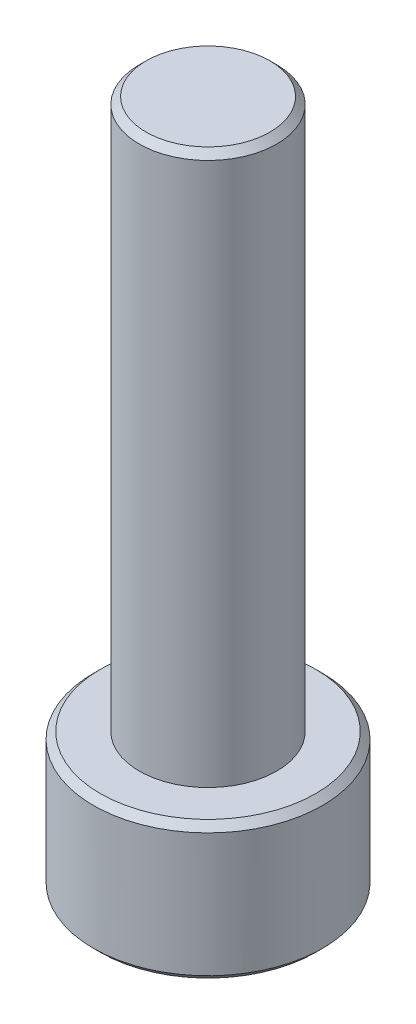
ISO-10303-21;
HEADER;
FILE_DESCRIPTION(('STEP AP214'),'2;1');
FILE_NAME('part.step','',(''),(''),'','','');
FILE_SCHEMA(('AUTOMOTIVE_DESIGN { 1 0 10303 214 1 1 1 1 }'));
ENDSEC;
DATA;
#1=APPLICATION_CONTEXT('core data for automotive mechanical design processes');
#2=APPLICATION_PROTOCOL_DEFINITION('international standard','automotive_design',2000,#1);
#3=PRODUCT_CONTEXT('',#1,'mechanical');
#4=PRODUCT('Part','Part','',(#3));
#5=PRODUCT_RELATED_PRODUCT_CATEGORY('part','',(#4));
#6=PRODUCT_DEFINITION_FORMATION('','',#4);
#7=PRODUCT_DEFINITION_CONTEXT('part definition',#1,'design');
#8=PRODUCT_DEFINITION('design','',#6,#7);
#9=PRODUCT_DEFINITION_SHAPE('','',#8);
#10=(LENGTH_UNIT() NAMED_UNIT(*) SI_UNIT(.MILLI.,.METRE.));
#11=(NAMED_UNIT(*) PLANE_ANGLE_UNIT() SI_UNIT($,.RADIAN.));
#12=(NAMED_UNIT(*) SI_UNIT($,.STERADIAN.) SOLID_ANGLE_UNIT());
#13=UNCERTAINTY_MEASURE_WITH_UNIT(LENGTH_MEASURE(1.E-05),#10,'distance_accuracy_value','');
#14=(GEOMETRIC_REPRESENTATION_CONTEXT(3) GLOBAL_UNCERTAINTY_ASSIGNED_CONTEXT((#13)) GLOBAL_UNIT_ASSIGNED_CONTEXT((#10,
#11,#12)) REPRESENTATION_CONTEXT('',''));
#15=CARTESIAN_POINT('',(0.,0.,0.));
#16=DIRECTION('',(0.,0.,1.));
#17=DIRECTION('',(1.,0.,0.));
#18=AXIS2_PLACEMENT_3D('',#15,#16,#17);
#19=CARTESIAN_POINT('',(0.,5.99999999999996,0.));
#20=DIRECTION('',(0.,1.,0.));
#21=DIRECTION('',(0.,0.,1.));
#22=AXIS2_PLACEMENT_3D('',#19,#20,#21);
#23=PLANE('',#22);
#24=CARTESIAN_POINT('',(0.,5.99999999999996,0.));
#25=DIRECTION('',(0.,1.,0.));
#26=DIRECTION('',(0.,0.,1.));
#27=AXIS2_PLACEMENT_3D('',#24,#25,#26);
#28=CIRCLE('',#27,4.7);
#29=CARTESIAN_POINT('',(0.,5.99999999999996,-4.70000000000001));
#30=VERTEX_POINT('',#29);
#31=EDGE_CURVE('E153',#30,#30,#28,.T.);
#32=ORIENTED_EDGE('',*,*,#31,.T.);
#33=EDGE_LOOP('',(#32));
#34=FACE_BOUND('',#33,.T.);
#35=CARTESIAN_POINT('',(0.,5.99999999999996,0.));
#36=DIRECTION('',(0.,1.,0.));
#37=DIRECTION('',(0.,0.,1.));
#38=AXIS2_PLACEMENT_3D('',#35,#36,#37);
#39=CIRCLE('',#38,3.);
#40=CARTESIAN_POINT('',(0.,5.99999999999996,-3.00000000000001));
#41=VERTEX_POINT('',#40);
#42=EDGE_CURVE('E136',#41,#41,#39,.T.);
#43=ORIENTED_EDGE('',*,*,#42,.F.);
#44=EDGE_LOOP('',(#43));
#45=FACE_BOUND('',#44,.T.);
#46=ADVANCED_FACE('F34',(#34,#45),#23,.T.);
#47=CARTESIAN_POINT('',(0.,5.99999999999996,0.));
#48=DIRECTION('',(0.,-1.,0.));
#49=DIRECTION('',(0.,0.,-1.));
#50=AXIS2_PLACEMENT_3D('',#47,#48,#49);
#51=CYLINDRICAL_SURFACE('',#50,5.);
#52=CARTESIAN_POINT('',(0.,0.299999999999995,0.));
#53=DIRECTION('',(0.,1.,0.));
#54=DIRECTION('',(0.,0.,1.));
#55=AXIS2_PLACEMENT_3D('',#52,#53,#54);
#56=CIRCLE('',#55,5.);
#57=CARTESIAN_POINT('',(0.,0.299999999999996,-5.00000000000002));
#58=VERTEX_POINT('',#57);
#59=EDGE_CURVE('E147',#58,#58,#56,.T.);
#60=CARTESIAN_POINT('',(0.,5.69999999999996,0.));
#61=DIRECTION('',(0.,0.999999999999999,0.));
#62=DIRECTION('',(0.,0.,1.));
#63=AXIS2_PLACEMENT_3D('',#60,#61,#62);
#64=CIRCLE('',#63,5.);
#65=CARTESIAN_POINT('',(0.,5.69999999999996,-5.00000000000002));
#66=VERTEX_POINT('',#65);
#67=EDGE_CURVE('E144',#66,#66,#64,.F.);
#68=CARTESIAN_POINT('',(0.,0.299999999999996,-5.00000000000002));
#69=CARTESIAN_POINT('',(0.,0.356249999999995,-5.00000000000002));
#70=CARTESIAN_POINT('',(0.,0.412499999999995,-5.00000000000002));
#71=CARTESIAN_POINT('',(0.,0.524999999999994,-5.00000000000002));
#72=CARTESIAN_POINT('',(0.,0.581249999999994,-5.00000000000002));
#73=CARTESIAN_POINT('',(0.,0.693749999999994,-5.00000000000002));
#74=CARTESIAN_POINT('',(0.,0.749999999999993,-5.00000000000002));
#75=CARTESIAN_POINT('',(0.,0.862499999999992,-5.00000000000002));
#76=CARTESIAN_POINT('',(0.,0.918749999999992,-5.00000000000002));
#77=CARTESIAN_POINT('',(0.,1.03124999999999,-5.00000000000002));
#78=CARTESIAN_POINT('',(0.,1.08749999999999,-5.00000000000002));
#79=CARTESIAN_POINT('',(0.,1.19999999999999,-5.00000000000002));
#80=CARTESIAN_POINT('',(0.,1.25624999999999,-5.00000000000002));
#81=CARTESIAN_POINT('',(0.,1.36874999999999,-5.00000000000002));
#82=CARTESIAN_POINT('',(0.,1.42499999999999,-5.00000000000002));
#83=CARTESIAN_POINT('',(0.,1.53749999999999,-5.00000000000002));
#84=CARTESIAN_POINT('',(0.,1.59374999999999,-5.00000000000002));
#85=CARTESIAN_POINT('',(0.,1.70624999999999,-5.00000000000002));
#86=CARTESIAN_POINT('',(0.,1.76249999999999,-5.00000000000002));
#87=CARTESIAN_POINT('',(0.,1.87499999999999,-5.00000000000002));
#88=CARTESIAN_POINT('',(0.,1.93124999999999,-5.00000000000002));
#89=CARTESIAN_POINT('',(0.,2.04374999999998,-5.00000000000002));
#90=CARTESIAN_POINT('',(0.,2.09999999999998,-5.00000000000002));
#91=CARTESIAN_POINT('',(0.,2.21249999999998,-5.00000000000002));
#92=CARTESIAN_POINT('',(0.,2.26874999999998,-5.00000000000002));
#93=CARTESIAN_POINT('',(0.,2.38124999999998,-5.00000000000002));
#94=CARTESIAN_POINT('',(0.,2.43749999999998,-5.00000000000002));
#95=CARTESIAN_POINT('',(0.,2.54999999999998,-5.00000000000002));
#96=CARTESIAN_POINT('',(0.,2.60624999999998,-5.00000000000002));
#97=CARTESIAN_POINT('',(0.,2.71874999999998,-5.00000000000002));
#98=CARTESIAN_POINT('',(0.,2.77499999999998,-5.00000000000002));
#99=CARTESIAN_POINT('',(0.,2.88749999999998,-5.00000000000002));
#100=CARTESIAN_POINT('',(0.,2.94374999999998,-5.00000000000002));
#101=CARTESIAN_POINT('',(0.,3.05624999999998,-5.00000000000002));
#102=CARTESIAN_POINT('',(0.,3.11249999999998,-5.00000000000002));
#103=CARTESIAN_POINT('',(0.,3.22499999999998,-5.00000000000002));
#104=CARTESIAN_POINT('',(0.,3.28124999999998,-5.00000000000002));
#105=CARTESIAN_POINT('',(0.,3.39374999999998,-5.00000000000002));
#106=CARTESIAN_POINT('',(0.,3.44999999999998,-5.00000000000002));
#107=CARTESIAN_POINT('',(0.,3.56249999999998,-5.00000000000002));
#108=CARTESIAN_POINT('',(0.,3.61874999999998,-5.00000000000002));
#109=CARTESIAN_POINT('',(0.,3.73124999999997,-5.00000000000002));
#110=CARTESIAN_POINT('',(0.,3.78749999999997,-5.00000000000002));
#111=CARTESIAN_POINT('',(0.,3.89999999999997,-5.00000000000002));
#112=CARTESIAN_POINT('',(0.,3.95624999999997,-5.00000000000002));
#113=CARTESIAN_POINT('',(0.,4.06874999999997,-5.00000000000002));
#114=CARTESIAN_POINT('',(0.,4.12499999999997,-5.00000000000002));
#115=CARTESIAN_POINT('',(0.,4.23749999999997,-5.00000000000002));
#116=CARTESIAN_POINT('',(0.,4.29374999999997,-5.00000000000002));
#117=CARTESIAN_POINT('',(0.,4.40624999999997,-5.00000000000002));
#118=CARTESIAN_POINT('',(0.,4.46249999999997,-5.00000000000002));
#119=CARTESIAN_POINT('',(0.,4.57499999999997,-5.00000000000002));
#120=CARTESIAN_POINT('',(0.,4.63124999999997,-5.00000000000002));
#121=CARTESIAN_POINT('',(0.,4.74374999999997,-5.00000000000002));
#122=CARTESIAN_POINT('',(0.,4.79999999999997,-5.00000000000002));
#123=CARTESIAN_POINT('',(0.,4.91249999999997,-5.00000000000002));
#124=CARTESIAN_POINT('',(0.,4.96874999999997,-5.00000000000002));
#125=CARTESIAN_POINT('',(0.,5.08124999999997,-5.00000000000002));
#126=CARTESIAN_POINT('',(0.,5.13749999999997,-5.00000000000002));
#127=CARTESIAN_POINT('',(0.,5.24999999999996,-5.00000000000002));
#128=CARTESIAN_POINT('',(0.,5.30624999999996,-5.00000000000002));
#129=CARTESIAN_POINT('',(0.,5.41874999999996,-5.00000000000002));
#130=CARTESIAN_POINT('',(0.,5.47499999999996,-5.00000000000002));
#131=CARTESIAN_POINT('',(0.,5.58749999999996,-5.00000000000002));
#132=CARTESIAN_POINT('',(0.,5.64374999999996,-5.00000000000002));
#133=CARTESIAN_POINT('',(0.,5.69999999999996,-5.00000000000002));
#134=B_SPLINE_CURVE_WITH_KNOTS('',3,(#68,#69,#70,#71,#72,#73,#74,#75,#76,#77,#78,#79,#80,#81,
#82,#83,#84,#85,#86,#87,#88,#89,#90,#91,#92,#93,#94,#95,#96,#97,#98,#99,#100,#101,#102,#103,
#104,#105,#106,#107,#108,#109,#110,#111,#112,#113,#114,#115,#116,#117,#118,#119,#120,#121,#122,
#123,#124,#125,#126,#127,#128,#129,#130,#131,#132,#133),.UNSPECIFIED.,.F.,.F.,(4,2,2,2,2,2,2,2,
2,2,2,2,2,2,2,2,2,2,2,2,2,2,2,2,2,2,2,2,2,2,2,2,4),(0.,0.168749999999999,0.337499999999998,
0.506249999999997,0.674999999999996,0.843749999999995,1.01249999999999,1.18124999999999,
1.34999999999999,1.51874999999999,1.68749999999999,1.85624999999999,2.02499999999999,
2.19374999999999,2.36249999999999,2.53124999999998,2.69999999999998,2.86874999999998,
3.03749999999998,3.20624999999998,3.37499999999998,3.54374999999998,3.71249999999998,
3.88124999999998,4.04999999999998,4.21874999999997,4.38749999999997,4.55624999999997,
4.72499999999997,4.89374999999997,5.06249999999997,5.23124999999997,5.39999999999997),.UNSPECIFIED.);
#135=EDGE_CURVE('BSEAM174',#58,#66,#134,.T.);
#136=ORIENTED_EDGE('',*,*,#59,.T.);
#137=ORIENTED_EDGE('',*,*,#67,.T.);
#138=ORIENTED_EDGE('',*,*,#135,.T.);
#139=ORIENTED_EDGE('',*,*,#135,.F.);
#140=EDGE_LOOP('',(#136,#138,#137,#139));
#141=FACE_BOUND('',#140,.T.);
#142=ADVANCED_FACE('F174',(#141),#51,.T.);
#143=CARTESIAN_POINT('',(0.,0.,0.));
#144=DIRECTION('',(0.,1.,0.));
#145=DIRECTION('',(0.,0.,1.));
#146=AXIS2_PLACEMENT_3D('',#143,#144,#145);
#147=PLANE('',#146);
#148=DIRECTION('',(-0.5,0.,0.866025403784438));
#149=VECTOR('',#148,1.);
#150=CARTESIAN_POINT('',(2.88675134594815,0.,0.));
#151=LINE('',#150,#149);
#152=CARTESIAN_POINT('',(2.88675134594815,0.,0.));
#153=VERTEX_POINT('',#152);
#154=CARTESIAN_POINT('',(1.44337567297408,0.,2.49999999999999));
#155=VERTEX_POINT('',#154);
#156=EDGE_CURVE('E123',#153,#155,#151,.T.);
#157=ORIENTED_EDGE('',*,*,#156,.F.);
#158=DIRECTION('',(0.5,0.,0.866025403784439));
#159=VECTOR('',#158,1.);
#160=CARTESIAN_POINT('',(1.44337567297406,0.,-2.50000000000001));
#161=LINE('',#160,#159);
#162=CARTESIAN_POINT('',(1.44337567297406,0.,-2.50000000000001));
#163=VERTEX_POINT('',#162);
#164=EDGE_CURVE('E49',#163,#153,#161,.T.);
#165=ORIENTED_EDGE('',*,*,#164,.F.);
#166=DIRECTION('',(1.,0.,0.));
#167=VECTOR('',#166,1.);
#168=CARTESIAN_POINT('',(-1.44337567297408,0.,-2.5));
#169=LINE('',#168,#167);
#170=CARTESIAN_POINT('',(-1.44337567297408,0.,-2.5));
#171=VERTEX_POINT('',#170);
#172=EDGE_CURVE('E132',#171,#163,#169,.T.);
#173=ORIENTED_EDGE('',*,*,#172,.F.);
#174=DIRECTION('',(0.5,0.,-0.866025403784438));
#175=VECTOR('',#174,1.);
#176=CARTESIAN_POINT('',(-2.88675134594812,0.,0.));
#177=LINE('',#176,#175);
#178=CARTESIAN_POINT('',(-2.88675134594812,0.,0.));
#179=VERTEX_POINT('',#178);
#180=EDGE_CURVE('E130',#179,#171,#177,.T.);
#181=ORIENTED_EDGE('',*,*,#180,.F.);
#182=DIRECTION('',(-0.500000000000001,0.,-0.866025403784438));
#183=VECTOR('',#182,1.);
#184=CARTESIAN_POINT('',(-1.44337567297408,0.,2.5));
#185=LINE('',#184,#183);
#186=CARTESIAN_POINT('',(-1.44337567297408,0.,2.5));
#187=VERTEX_POINT('',#186);
#188=EDGE_CURVE('E97',#187,#179,#185,.T.);
#189=ORIENTED_EDGE('',*,*,#188,.F.);
#190=DIRECTION('',(-1.,0.,0.));
#191=VECTOR('',#190,1.);
#192=CARTESIAN_POINT('',(1.44337567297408,0.,2.49999999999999));
#193=LINE('',#192,#191);
#194=EDGE_CURVE('E126',#155,#187,#193,.T.);
#195=ORIENTED_EDGE('',*,*,#194,.F.);
#196=EDGE_LOOP('',(#157,#165,#173,#181,#189,#195));
#197=FACE_BOUND('',#196,.T.);
#198=CARTESIAN_POINT('',(0.,0.,0.));
#199=DIRECTION('',(0.,1.,0.));
#200=DIRECTION('',(0.,0.,1.));
#201=AXIS2_PLACEMENT_3D('',#198,#199,#200);
#202=CIRCLE('',#201,4.7);
#203=CARTESIAN_POINT('',(0.,0.,4.7));
#204=VERTEX_POINT('',#203);
#205=EDGE_CURVE('E150',#204,#204,#202,.F.);
#206=ORIENTED_EDGE('',*,*,#205,.T.);
#207=EDGE_LOOP('',(#206));
#208=FACE_BOUND('',#207,.T.);
#209=ADVANCED_FACE('F180',(#197,#208),#147,.F.);
#210=CARTESIAN_POINT('',(0.,30.,0.));
#211=DIRECTION('',(0.,-1.,0.));
#212=DIRECTION('',(0.,0.,-1.));
#213=AXIS2_PLACEMENT_3D('',#210,#211,#212);
#214=CYLINDRICAL_SURFACE('',#213,3.);
#215=CARTESIAN_POINT('',(0.,29.7,0.));
#216=DIRECTION('',(0.,1.,0.));
#217=DIRECTION('',(0.,0.,1.));
#218=AXIS2_PLACEMENT_3D('',#215,#216,#217);
#219=CIRCLE('',#218,3.);
#220=CARTESIAN_POINT('',(0.,29.7,-3.00000000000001));
#221=VERTEX_POINT('',#220);
#222=EDGE_CURVE('E11',#221,#221,#219,.F.);
#223=CARTESIAN_POINT('',(0.,29.7,-3.00000000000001));
#224=CARTESIAN_POINT('',(0.,29.453125,-3.00000000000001));
#225=CARTESIAN_POINT('',(0.,29.20625,-3.00000000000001));
#226=CARTESIAN_POINT('',(0.,28.7125,-3.00000000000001));
#227=CARTESIAN_POINT('',(0.,28.465625,-3.00000000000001));
#228=CARTESIAN_POINT('',(0.,27.971875,-3.00000000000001));
#229=CARTESIAN_POINT('',(0.,27.725,-3.00000000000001));
#230=CARTESIAN_POINT('',(0.,27.23125,-3.00000000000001));
#231=CARTESIAN_POINT('',(0.,26.984375,-3.00000000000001));
#232=CARTESIAN_POINT('',(0.,26.490625,-3.00000000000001));
#233=CARTESIAN_POINT('',(0.,26.24375,-3.00000000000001));
#234=CARTESIAN_POINT('',(0.,25.75,-3.00000000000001));
#235=CARTESIAN_POINT('',(0.,25.503125,-3.00000000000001));
#236=CARTESIAN_POINT('',(0.,25.009375,-3.00000000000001));
#237=CARTESIAN_POINT('',(0.,24.7625,-3.00000000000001));
#238=CARTESIAN_POINT('',(0.,24.26875,-3.00000000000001));
#239=CARTESIAN_POINT('',(0.,24.021875,-3.00000000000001));
#240=CARTESIAN_POINT('',(0.,23.528125,-3.00000000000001));
#241=CARTESIAN_POINT('',(0.,23.28125,-3.00000000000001));
#242=CARTESIAN_POINT('',(0.,22.7875,-3.00000000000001));
#243=CARTESIAN_POINT('',(0.,22.540625,-3.00000000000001));
#244=CARTESIAN_POINT('',(0.,22.046875,-3.00000000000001));
#245=CARTESIAN_POINT('',(0.,21.8,-3.00000000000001));
#246=CARTESIAN_POINT('',(0.,21.30625,-3.00000000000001));
#247=CARTESIAN_POINT('',(0.,21.059375,-3.00000000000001));
#248=CARTESIAN_POINT('',(0.,20.565625,-3.00000000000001));
#249=CARTESIAN_POINT('',(0.,20.31875,-3.00000000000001));
#250=CARTESIAN_POINT('',(0.,19.825,-3.00000000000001));
#251=CARTESIAN_POINT('',(0.,19.578125,-3.00000000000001));
#252=CARTESIAN_POINT('',(0.,19.084375,-3.00000000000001));
#253=CARTESIAN_POINT('',(0.,18.8375,-3.00000000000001));
#254=CARTESIAN_POINT('',(0.,18.34375,-3.00000000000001));
#255=CARTESIAN_POINT('',(0.,18.096875,-3.00000000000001));
#256=CARTESIAN_POINT('',(0.,17.603125,-3.00000000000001));
#257=CARTESIAN_POINT('',(0.,17.35625,-3.00000000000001));
#258=CARTESIAN_POINT('',(0.,16.8625,-3.00000000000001));
#259=CARTESIAN_POINT('',(0.,16.615625,-3.00000000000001));
#260=CARTESIAN_POINT('',(0.,16.121875,-3.00000000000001));
#261=CARTESIAN_POINT('',(0.,15.875,-3.00000000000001));
#262=CARTESIAN_POINT('',(0.,15.38125,-3.00000000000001));
#263=CARTESIAN_POINT('',(0.,15.134375,-3.00000000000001));
#264=CARTESIAN_POINT('',(0.,14.640625,-3.00000000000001));
#265=CARTESIAN_POINT('',(0.,14.39375,-3.00000000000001));
#266=CARTESIAN_POINT('',(0.,13.9,-3.00000000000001));
#267=CARTESIAN_POINT('',(0.,13.653125,-3.00000000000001));
#268=CARTESIAN_POINT('',(0.,13.159375,-3.00000000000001));
#269=CARTESIAN_POINT('',(0.,12.9125,-3.00000000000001));
#270=CARTESIAN_POINT('',(0.,12.41875,-3.00000000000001));
#271=CARTESIAN_POINT('',(0.,12.171875,-3.00000000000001));
#272=CARTESIAN_POINT('',(0.,11.678125,-3.00000000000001));
#273=CARTESIAN_POINT('',(0.,11.43125,-3.00000000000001));
#274=CARTESIAN_POINT('',(0.,10.9375,-3.00000000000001));
#275=CARTESIAN_POINT('',(0.,10.690625,-3.00000000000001));
#276=CARTESIAN_POINT('',(0.,10.196875,-3.00000000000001));
#277=CARTESIAN_POINT('',(0.,9.94999999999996,-3.00000000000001));
#278=CARTESIAN_POINT('',(0.,9.45624999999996,-3.00000000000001));
#279=CARTESIAN_POINT('',(0.,9.20937499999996,-3.00000000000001));
#280=CARTESIAN_POINT('',(0.,8.71562499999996,-3.00000000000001));
#281=CARTESIAN_POINT('',(0.,8.46874999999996,-3.00000000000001));
#282=CARTESIAN_POINT('',(0.,7.97499999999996,-3.00000000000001));
#283=CARTESIAN_POINT('',(0.,7.72812499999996,-3.00000000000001));
#284=CARTESIAN_POINT('',(0.,7.23437499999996,-3.00000000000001));
#285=CARTESIAN_POINT('',(0.,6.98749999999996,-3.00000000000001));
#286=CARTESIAN_POINT('',(0.,6.49374999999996,-3.00000000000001));
#287=CARTESIAN_POINT('',(0.,6.24687499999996,-3.00000000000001));
#288=CARTESIAN_POINT('',(0.,5.99999999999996,-3.00000000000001));
#289=B_SPLINE_CURVE_WITH_KNOTS('',3,(#223,#224,#225,#226,#227,#228,#229,#230,#231,#232,#233,
#234,#235,#236,#237,#238,#239,#240,#241,#242,#243,#244,#245,#246,#247,#248,#249,#250,#251,#252,
#253,#254,#255,#256,#257,#258,#259,#260,#261,#262,#263,#264,#265,#266,#267,#268,#269,#270,#271,
#272,#273,#274,#275,#276,#277,#278,#279,#280,#281,#282,#283,#284,#285,#286,#287,#288),
.UNSPECIFIED.,.F.,.F.,(4,2,2,2,2,2,2,2,2,2,2,2,2,2,2,2,2,2,2,2,2,2,2,2,2,2,2,2,2,2,2,2,4),(0.,
0.740624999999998,1.48125,2.221875,2.9625,3.703125,4.44375,5.184375,5.925,6.66562499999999,
7.40625,8.146875,8.8875,9.62812499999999,10.36875,11.109375,11.85,12.590625,13.33125,14.071875,
14.8125,15.553125,16.29375,17.034375,17.775,18.515625,19.25625,19.996875,20.7375,21.478125,
22.21875,22.959375,23.7),.UNSPECIFIED.);
#290=EDGE_CURVE('BSEAM186',#221,#41,#289,.T.);
#291=ORIENTED_EDGE('',*,*,#222,.T.);
#292=ORIENTED_EDGE('',*,*,#42,.T.);
#293=ORIENTED_EDGE('',*,*,#290,.T.);
#294=ORIENTED_EDGE('',*,*,#290,.F.);
#295=EDGE_LOOP('',(#291,#293,#292,#294));
#296=FACE_BOUND('',#295,.T.);
#297=ADVANCED_FACE('F186',(#296),#214,.T.);
#298=CARTESIAN_POINT('',(0.,30.,0.));
#299=DIRECTION('',(0.,1.,0.));
#300=DIRECTION('',(0.,0.,1.));
#301=AXIS2_PLACEMENT_3D('',#298,#299,#300);
#302=PLANE('',#301);
#303=CARTESIAN_POINT('',(0.,30.,0.));
#304=DIRECTION('',(0.,1.,0.));
#305=DIRECTION('',(0.,0.,1.));
#306=AXIS2_PLACEMENT_3D('',#303,#304,#305);
#307=CIRCLE('',#306,2.7);
#308=CARTESIAN_POINT('',(0.,30.,-2.70000000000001));
#309=VERTEX_POINT('',#308);
#310=EDGE_CURVE('E42',#309,#309,#307,.T.);
#311=ORIENTED_EDGE('',*,*,#310,.T.);
#312=EDGE_LOOP('',(#311));
#313=FACE_BOUND('',#312,.T.);
#314=ADVANCED_FACE('F158',(#313),#302,.T.);
#315=CARTESIAN_POINT('',(0.,0.299999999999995,0.));
#316=DIRECTION('',(0.,1.,0.));
#317=DIRECTION('',(0.,0.,1.));
#318=AXIS2_PLACEMENT_3D('',#315,#316,#317);
#319=CONICAL_SURFACE('',#318,5.,0.785398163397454);
#320=ORIENTED_EDGE('',*,*,#205,.F.);
#321=EDGE_LOOP('',(#320));
#322=FACE_BOUND('',#321,.T.);
#323=ORIENTED_EDGE('',*,*,#59,.F.);
#324=EDGE_LOOP('',(#323));
#325=FACE_BOUND('',#324,.T.);
#326=ADVANCED_FACE('F170',(#322,#325),#319,.T.);
#327=CARTESIAN_POINT('',(0.,5.99999999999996,0.));
#328=DIRECTION('',(0.,-0.999999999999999,0.));
#329=DIRECTION('',(0.,0.,-1.));
#330=AXIS2_PLACEMENT_3D('',#327,#328,#329);
#331=CONICAL_SURFACE('',#330,4.7,0.785398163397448);
#332=CARTESIAN_POINT('',(0.,5.69999999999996,-5.00000000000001));
#333=CARTESIAN_POINT('',(0.,5.70312499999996,-4.99687500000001));
#334=CARTESIAN_POINT('',(0.,5.70624999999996,-4.99375000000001));
#335=CARTESIAN_POINT('',(0.,5.71249999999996,-4.98750000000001));
#336=CARTESIAN_POINT('',(0.,5.71562499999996,-4.98437500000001));
#337=CARTESIAN_POINT('',(0.,5.72187499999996,-4.97812500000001));
#338=CARTESIAN_POINT('',(0.,5.72499999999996,-4.97500000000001));
#339=CARTESIAN_POINT('',(0.,5.73124999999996,-4.96875000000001));
#340=CARTESIAN_POINT('',(0.,5.73437499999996,-4.96562500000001));
#341=CARTESIAN_POINT('',(0.,5.74062499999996,-4.95937500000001));
#342=CARTESIAN_POINT('',(0.,5.74374999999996,-4.95625000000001));
#343=CARTESIAN_POINT('',(0.,5.74999999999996,-4.95000000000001));
#344=CARTESIAN_POINT('',(0.,5.75312499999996,-4.94687500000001));
#345=CARTESIAN_POINT('',(0.,5.75937499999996,-4.94062500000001));
#346=CARTESIAN_POINT('',(0.,5.76249999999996,-4.93750000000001));
#347=CARTESIAN_POINT('',(0.,5.76874999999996,-4.93125000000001));
#348=CARTESIAN_POINT('',(0.,5.77187499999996,-4.92812500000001));
#349=CARTESIAN_POINT('',(0.,5.77812499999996,-4.92187500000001));
#350=CARTESIAN_POINT('',(0.,5.78124999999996,-4.91875000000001));
#351=CARTESIAN_POINT('',(0.,5.78749999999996,-4.91250000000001));
#352=CARTESIAN_POINT('',(0.,5.79062499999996,-4.90937500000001));
#353=CARTESIAN_POINT('',(0.,5.79687499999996,-4.90312500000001));
#354=CARTESIAN_POINT('',(0.,5.79999999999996,-4.90000000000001));
#355=CARTESIAN_POINT('',(0.,5.80624999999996,-4.89375000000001));
#356=CARTESIAN_POINT('',(0.,5.80937499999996,-4.89062500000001));
#357=CARTESIAN_POINT('',(0.,5.81562499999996,-4.88437500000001));
#358=CARTESIAN_POINT('',(0.,5.81874999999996,-4.88125000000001));
#359=CARTESIAN_POINT('',(0.,5.82499999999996,-4.87500000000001));
#360=CARTESIAN_POINT('',(0.,5.82812499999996,-4.87187500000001));
#361=CARTESIAN_POINT('',(0.,5.83437499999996,-4.86562500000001));
#362=CARTESIAN_POINT('',(0.,5.83749999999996,-4.86250000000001));
#363=CARTESIAN_POINT('',(0.,5.84374999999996,-4.85625000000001));
#364=CARTESIAN_POINT('',(0.,5.84687499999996,-4.85312500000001));
#365=CARTESIAN_POINT('',(0.,5.85312499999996,-4.84687500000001));
#366=CARTESIAN_POINT('',(0.,5.85624999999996,-4.84375000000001));
#367=CARTESIAN_POINT('',(0.,5.86249999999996,-4.83750000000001));
#368=CARTESIAN_POINT('',(0.,5.86562499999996,-4.83437500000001));
#369=CARTESIAN_POINT('',(0.,5.87187499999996,-4.82812500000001));
#370=CARTESIAN_POINT('',(0.,5.87499999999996,-4.82500000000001));
#371=CARTESIAN_POINT('',(0.,5.88124999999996,-4.81875000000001));
#372=CARTESIAN_POINT('',(0.,5.88437499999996,-4.81562500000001));
#373=CARTESIAN_POINT('',(0.,5.89062499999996,-4.80937500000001));
#374=CARTESIAN_POINT('',(0.,5.89374999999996,-4.80625000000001));
#375=CARTESIAN_POINT('',(0.,5.89999999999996,-4.80000000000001));
#376=CARTESIAN_POINT('',(0.,5.90312499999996,-4.79687500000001));
#377=CARTESIAN_POINT('',(0.,5.90937499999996,-4.79062500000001));
#378=CARTESIAN_POINT('',(0.,5.91249999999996,-4.78750000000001));
#379=CARTESIAN_POINT('',(0.,5.91874999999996,-4.78125000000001));
#380=CARTESIAN_POINT('',(0.,5.92187499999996,-4.77812500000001));
#381=CARTESIAN_POINT('',(0.,5.92812499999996,-4.77187500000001));
#382=CARTESIAN_POINT('',(0.,5.93124999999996,-4.76875000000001));
#383=CARTESIAN_POINT('',(0.,5.93749999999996,-4.76250000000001));
#384=CARTESIAN_POINT('',(0.,5.94062499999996,-4.75937500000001));
#385=CARTESIAN_POINT('',(0.,5.94687499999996,-4.75312500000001));
#386=CARTESIAN_POINT('',(0.,5.94999999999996,-4.75000000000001));
#387=CARTESIAN_POINT('',(0.,5.95624999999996,-4.74375000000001));
#388=CARTESIAN_POINT('',(0.,5.95937499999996,-4.74062500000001));
#389=CARTESIAN_POINT('',(0.,5.96562499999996,-4.73437500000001));
#390=CARTESIAN_POINT('',(0.,5.96874999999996,-4.73125000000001));
#391=CARTESIAN_POINT('',(0.,5.97499999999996,-4.72500000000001));
#392=CARTESIAN_POINT('',(0.,5.97812499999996,-4.72187500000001));
#393=CARTESIAN_POINT('',(0.,5.98437499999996,-4.71562500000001));
#394=CARTESIAN_POINT('',(0.,5.98749999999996,-4.71250000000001));
#395=CARTESIAN_POINT('',(0.,5.99374999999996,-4.70625000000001));
#396=CARTESIAN_POINT('',(0.,5.99687499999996,-4.70312500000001));
#397=CARTESIAN_POINT('',(0.,5.99999999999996,-4.70000000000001));
#398=B_SPLINE_CURVE_WITH_KNOTS('',3,(#332,#333,#334,#335,#336,#337,#338,#339,#340,#341,#342,
#343,#344,#345,#346,#347,#348,#349,#350,#351,#352,#353,#354,#355,#356,#357,#358,#359,#360,#361,
#362,#363,#364,#365,#366,#367,#368,#369,#370,#371,#372,#373,#374,#375,#376,#377,#378,#379,#380,
#381,#382,#383,#384,#385,#386,#387,#388,#389,#390,#391,#392,#393,#394,#395,#396,#397),
.UNSPECIFIED.,.F.,.F.,(4,2,2,2,2,2,2,2,2,2,2,2,2,2,2,2,2,2,2,2,2,2,2,2,2,2,2,2,2,2,2,2,4),(0.,
0.0132582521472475,0.0265165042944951,0.0397747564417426,0.0530330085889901,0.0662912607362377,
0.0795495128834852,0.0928077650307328,0.10606601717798,0.119324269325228,0.132582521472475,
0.145840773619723,0.15909902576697,0.172357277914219,0.185615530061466,0.198873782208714,
0.212132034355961,0.225390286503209,0.238648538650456,0.251906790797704,0.265165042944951,
0.278423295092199,0.291681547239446,0.304939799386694,0.318198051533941,0.331456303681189,
0.344714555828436,0.357972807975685,0.371231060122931,0.38448931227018,0.397747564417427,
0.411005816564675,0.424264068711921),.UNSPECIFIED.);
#399=EDGE_CURVE('BSEAM162',#66,#30,#398,.T.);
#400=ORIENTED_EDGE('',*,*,#67,.F.);
#401=ORIENTED_EDGE('',*,*,#31,.F.);
#402=ORIENTED_EDGE('',*,*,#399,.T.);
#403=ORIENTED_EDGE('',*,*,#399,.F.);
#404=EDGE_LOOP('',(#400,#402,#401,#403));
#405=FACE_BOUND('',#404,.T.);
#406=ADVANCED_FACE('F162',(#405),#331,.T.);
#407=CARTESIAN_POINT('',(0.,30.,0.));
#408=DIRECTION('',(0.,-1.,0.));
#409=DIRECTION('',(0.,0.,-1.));
#410=AXIS2_PLACEMENT_3D('',#407,#408,#409);
#411=CONICAL_SURFACE('',#410,2.7,0.78539816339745);
#412=CARTESIAN_POINT('',(0.,29.7,-3.00000000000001));
#413=CARTESIAN_POINT('',(0.,29.703125,-2.99687500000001));
#414=CARTESIAN_POINT('',(0.,29.70625,-2.99375000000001));
#415=CARTESIAN_POINT('',(0.,29.7125,-2.98750000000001));
#416=CARTESIAN_POINT('',(0.,29.715625,-2.98437500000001));
#417=CARTESIAN_POINT('',(0.,29.721875,-2.97812500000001));
#418=CARTESIAN_POINT('',(0.,29.725,-2.97500000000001));
#419=CARTESIAN_POINT('',(0.,29.73125,-2.96875000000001));
#420=CARTESIAN_POINT('',(0.,29.734375,-2.96562500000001));
#421=CARTESIAN_POINT('',(0.,29.740625,-2.95937500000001));
#422=CARTESIAN_POINT('',(0.,29.74375,-2.95625000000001));
#423=CARTESIAN_POINT('',(0.,29.75,-2.95000000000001));
#424=CARTESIAN_POINT('',(0.,29.753125,-2.94687500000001));
#425=CARTESIAN_POINT('',(0.,29.759375,-2.94062500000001));
#426=CARTESIAN_POINT('',(0.,29.7625,-2.93750000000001));
#427=CARTESIAN_POINT('',(0.,29.76875,-2.93125000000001));
#428=CARTESIAN_POINT('',(0.,29.771875,-2.92812500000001));
#429=CARTESIAN_POINT('',(0.,29.778125,-2.92187500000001));
#430=CARTESIAN_POINT('',(0.,29.78125,-2.91875000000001));
#431=CARTESIAN_POINT('',(0.,29.7875,-2.91250000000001));
#432=CARTESIAN_POINT('',(0.,29.790625,-2.90937500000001));
#433=CARTESIAN_POINT('',(0.,29.796875,-2.90312500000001));
#434=CARTESIAN_POINT('',(0.,29.8,-2.90000000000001));
#435=CARTESIAN_POINT('',(0.,29.80625,-2.89375000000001));
#436=CARTESIAN_POINT('',(0.,29.809375,-2.89062500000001));
#437=CARTESIAN_POINT('',(0.,29.815625,-2.88437500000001));
#438=CARTESIAN_POINT('',(0.,29.81875,-2.88125000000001));
#439=CARTESIAN_POINT('',(0.,29.825,-2.87500000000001));
#440=CARTESIAN_POINT('',(0.,29.828125,-2.87187500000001));
#441=CARTESIAN_POINT('',(0.,29.834375,-2.86562500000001));
#442=CARTESIAN_POINT('',(0.,29.8375,-2.86250000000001));
#443=CARTESIAN_POINT('',(0.,29.84375,-2.85625000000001));
#444=CARTESIAN_POINT('',(0.,29.846875,-2.85312500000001));
#445=CARTESIAN_POINT('',(0.,29.853125,-2.84687500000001));
#446=CARTESIAN_POINT('',(0.,29.85625,-2.84375000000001));
#447=CARTESIAN_POINT('',(0.,29.8625,-2.83750000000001));
#448=CARTESIAN_POINT('',(0.,29.865625,-2.83437500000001));
#449=CARTESIAN_POINT('',(0.,29.871875,-2.82812500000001));
#450=CARTESIAN_POINT('',(0.,29.875,-2.82500000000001));
#451=CARTESIAN_POINT('',(0.,29.88125,-2.81875000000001));
#452=CARTESIAN_POINT('',(0.,29.884375,-2.81562500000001));
#453=CARTESIAN_POINT('',(0.,29.890625,-2.80937500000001));
#454=CARTESIAN_POINT('',(0.,29.89375,-2.80625000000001));
#455=CARTESIAN_POINT('',(0.,29.9,-2.80000000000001));
#456=CARTESIAN_POINT('',(0.,29.903125,-2.79687500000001));
#457=CARTESIAN_POINT('',(0.,29.909375,-2.79062500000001));
#458=CARTESIAN_POINT('',(0.,29.9125,-2.78750000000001));
#459=CARTESIAN_POINT('',(0.,29.91875,-2.78125000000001));
#460=CARTESIAN_POINT('',(0.,29.921875,-2.77812500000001));
#461=CARTESIAN_POINT('',(0.,29.928125,-2.77187500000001));
#462=CARTESIAN_POINT('',(0.,29.93125,-2.76875000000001));
#463=CARTESIAN_POINT('',(0.,29.9375,-2.76250000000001));
#464=CARTESIAN_POINT('',(0.,29.940625,-2.75937500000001));
#465=CARTESIAN_POINT('',(0.,29.946875,-2.75312500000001));
#466=CARTESIAN_POINT('',(0.,29.95,-2.75000000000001));
#467=CARTESIAN_POINT('',(0.,29.95625,-2.74375000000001));
#468=CARTESIAN_POINT('',(0.,29.959375,-2.74062500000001));
#469=CARTESIAN_POINT('',(0.,29.965625,-2.73437500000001));
#470=CARTESIAN_POINT('',(0.,29.96875,-2.73125000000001));
#471=CARTESIAN_POINT('',(0.,29.975,-2.72500000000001));
#472=CARTESIAN_POINT('',(0.,29.978125,-2.72187500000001));
#473=CARTESIAN_POINT('',(0.,29.984375,-2.71562500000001));
#474=CARTESIAN_POINT('',(0.,29.9875,-2.71250000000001));
#475=CARTESIAN_POINT('',(0.,29.99375,-2.70625000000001));
#476=CARTESIAN_POINT('',(0.,29.9968749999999,-2.70312500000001));
#477=CARTESIAN_POINT('',(0.,30.,-2.70000000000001));
#478=B_SPLINE_CURVE_WITH_KNOTS('',3,(#412,#413,#414,#415,#416,#417,#418,#419,#420,#421,#422,
#423,#424,#425,#426,#427,#428,#429,#430,#431,#432,#433,#434,#435,#436,#437,#438,#439,#440,#441,
#442,#443,#444,#445,#446,#447,#448,#449,#450,#451,#452,#453,#454,#455,#456,#457,#458,#459,#460,
#461,#462,#463,#464,#465,#466,#467,#468,#469,#470,#471,#472,#473,#474,#475,#476,#477),
.UNSPECIFIED.,.F.,.F.,(4,2,2,2,2,2,2,2,2,2,2,2,2,2,2,2,2,2,2,2,2,2,2,2,2,2,2,2,2,2,2,2,4),(0.,
0.0132582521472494,0.0265165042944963,0.0397747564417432,0.0530330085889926,0.0662912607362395,
0.0795495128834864,0.0928077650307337,0.106066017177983,0.11932426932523,0.132582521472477,
0.145840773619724,0.159099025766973,0.17235727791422,0.185615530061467,0.198873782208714,
0.212132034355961,0.22539028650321,0.238648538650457,0.251906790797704,0.265165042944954,
0.278423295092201,0.291681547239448,0.304939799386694,0.318198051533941,0.331456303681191,
0.344714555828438,0.357972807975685,0.371231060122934,0.384489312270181,0.397747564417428,
0.411005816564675,0.424264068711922),.UNSPECIFIED.);
#479=EDGE_CURVE('BSEAM36',#221,#309,#478,.T.);
#480=ORIENTED_EDGE('',*,*,#222,.F.);
#481=ORIENTED_EDGE('',*,*,#310,.F.);
#482=ORIENTED_EDGE('',*,*,#479,.T.);
#483=ORIENTED_EDGE('',*,*,#479,.F.);
#484=EDGE_LOOP('',(#480,#482,#481,#483));
#485=FACE_BOUND('',#484,.T.);
#486=ADVANCED_FACE('F36',(#485),#411,.T.);
#487=CARTESIAN_POINT('',(1.44337567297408,3.,-2.50000000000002));
#488=DIRECTION('',(0.866025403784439,0.,-0.5));
#489=DIRECTION('',(-0.5,0.,-0.866025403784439));
#490=AXIS2_PLACEMENT_3D('',#487,#488,#489);
#491=PLANE('',#490);
#492=ORIENTED_EDGE('',*,*,#164,.T.);
#493=DIRECTION('',(0.,-1.,0.));
#494=VECTOR('',#493,1.);
#495=CARTESIAN_POINT('',(2.88675134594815,3.,0.));
#496=LINE('',#495,#494);
#497=CARTESIAN_POINT('',(2.88675134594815,3.,0.));
#498=VERTEX_POINT('',#497);
#499=EDGE_CURVE('E79',#498,#153,#496,.T.);
#500=ORIENTED_EDGE('',*,*,#499,.F.);
#501=DIRECTION('',(0.5,0.,0.866025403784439));
#502=VECTOR('',#501,1.);
#503=CARTESIAN_POINT('',(1.44337567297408,3.,-2.50000000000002));
#504=LINE('',#503,#502);
#505=CARTESIAN_POINT('',(1.44337567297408,3.,-2.50000000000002));
#506=VERTEX_POINT('',#505);
#507=EDGE_CURVE('E134',#506,#498,#504,.T.);
#508=ORIENTED_EDGE('',*,*,#507,.F.);
#509=DIRECTION('',(0.,-1.,0.));
#510=VECTOR('',#509,1.);
#511=CARTESIAN_POINT('',(1.44337567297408,3.,-2.50000000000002));
#512=LINE('',#511,#510);
#513=EDGE_CURVE('E57',#506,#163,#512,.T.);
#514=ORIENTED_EDGE('',*,*,#513,.T.);
#515=EDGE_LOOP('',(#492,#500,#508,#514));
#516=FACE_BOUND('',#515,.T.);
#517=ADVANCED_FACE('F161',(#516),#491,.F.);
#518=CARTESIAN_POINT('',(-1.44337567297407,3.,-2.5));
#519=DIRECTION('',(0.,0.,-1.));
#520=DIRECTION('',(-1.,0.,0.));
#521=AXIS2_PLACEMENT_3D('',#518,#519,#520);
#522=PLANE('',#521);
#523=ORIENTED_EDGE('',*,*,#172,.T.);
#524=ORIENTED_EDGE('',*,*,#513,.F.);
#525=DIRECTION('',(1.,0.,0.));
#526=VECTOR('',#525,1.);
#527=CARTESIAN_POINT('',(-1.44337567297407,3.,-2.5));
#528=LINE('',#527,#526);
#529=CARTESIAN_POINT('',(-1.44337567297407,3.,-2.5));
#530=VERTEX_POINT('',#529);
#531=EDGE_CURVE('E109',#530,#506,#528,.T.);
#532=ORIENTED_EDGE('',*,*,#531,.F.);
#533=DIRECTION('',(0.,-1.,0.));
#534=VECTOR('',#533,1.);
#535=CARTESIAN_POINT('',(-1.44337567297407,3.,-2.5));
#536=LINE('',#535,#534);
#537=EDGE_CURVE('E101',#530,#171,#536,.T.);
#538=ORIENTED_EDGE('',*,*,#537,.T.);
#539=EDGE_LOOP('',(#523,#524,#532,#538));
#540=FACE_BOUND('',#539,.T.);
#541=ADVANCED_FACE('F168',(#540),#522,.F.);
#542=CARTESIAN_POINT('',(-2.88675134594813,3.,0.));
#543=DIRECTION('',(-0.866025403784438,0.,-0.5));
#544=DIRECTION('',(-0.5,0.,0.866025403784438));
#545=AXIS2_PLACEMENT_3D('',#542,#543,#544);
#546=PLANE('',#545);
#547=ORIENTED_EDGE('',*,*,#180,.T.);
#548=ORIENTED_EDGE('',*,*,#537,.F.);
#549=DIRECTION('',(0.5,0.,-0.866025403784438));
#550=VECTOR('',#549,1.);
#551=CARTESIAN_POINT('',(-2.88675134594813,3.,0.));
#552=LINE('',#551,#550);
#553=CARTESIAN_POINT('',(-2.88675134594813,3.,0.));
#554=VERTEX_POINT('',#553);
#555=EDGE_CURVE('E105',#554,#530,#552,.T.);
#556=ORIENTED_EDGE('',*,*,#555,.F.);
#557=DIRECTION('',(0.,-1.,0.));
#558=VECTOR('',#557,1.);
#559=CARTESIAN_POINT('',(-2.88675134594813,3.,0.));
#560=LINE('',#559,#558);
#561=EDGE_CURVE('E90',#554,#179,#560,.T.);
#562=ORIENTED_EDGE('',*,*,#561,.T.);
#563=EDGE_LOOP('',(#547,#548,#556,#562));
#564=FACE_BOUND('',#563,.T.);
#565=ADVANCED_FACE('F106',(#564),#546,.F.);
#566=CARTESIAN_POINT('',(-1.44337567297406,3.,2.49999999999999));
#567=DIRECTION('',(-0.866025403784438,0.,0.5));
#568=DIRECTION('',(0.500000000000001,0.,0.866025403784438));
#569=AXIS2_PLACEMENT_3D('',#566,#567,#568);
#570=PLANE('',#569);
#571=ORIENTED_EDGE('',*,*,#188,.T.);
#572=ORIENTED_EDGE('',*,*,#561,.F.);
#573=DIRECTION('',(-0.500000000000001,0.,-0.866025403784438));
#574=VECTOR('',#573,1.);
#575=CARTESIAN_POINT('',(-1.44337567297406,3.,2.49999999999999));
#576=LINE('',#575,#574);
#577=CARTESIAN_POINT('',(-1.44337567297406,3.,2.49999999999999));
#578=VERTEX_POINT('',#577);
#579=EDGE_CURVE('E94',#578,#554,#576,.T.);
#580=ORIENTED_EDGE('',*,*,#579,.F.);
#581=DIRECTION('',(0.,-1.,0.));
#582=VECTOR('',#581,1.);
#583=CARTESIAN_POINT('',(-1.44337567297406,3.,2.49999999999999));
#584=LINE('',#583,#582);
#585=EDGE_CURVE('E102',#578,#187,#584,.T.);
#586=ORIENTED_EDGE('',*,*,#585,.T.);
#587=EDGE_LOOP('',(#571,#572,#580,#586));
#588=FACE_BOUND('',#587,.T.);
#589=ADVANCED_FACE('F92',(#588),#570,.F.);
#590=CARTESIAN_POINT('',(1.44337567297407,3.,2.49999999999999));
#591=DIRECTION('',(0.,0.,1.));
#592=DIRECTION('',(1.,0.,0.));
#593=AXIS2_PLACEMENT_3D('',#590,#591,#592);
#594=PLANE('',#593);
#595=ORIENTED_EDGE('',*,*,#194,.T.);
#596=ORIENTED_EDGE('',*,*,#585,.F.);
#597=DIRECTION('',(-1.,0.,0.));
#598=VECTOR('',#597,1.);
#599=CARTESIAN_POINT('',(1.44337567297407,3.,2.49999999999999));
#600=LINE('',#599,#598);
#601=CARTESIAN_POINT('',(1.44337567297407,3.,2.49999999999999));
#602=VERTEX_POINT('',#601);
#603=EDGE_CURVE('E115',#602,#578,#600,.T.);
#604=ORIENTED_EDGE('',*,*,#603,.F.);
#605=DIRECTION('',(0.,-1.,0.));
#606=VECTOR('',#605,1.);
#607=CARTESIAN_POINT('',(1.44337567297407,3.,2.49999999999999));
#608=LINE('',#607,#606);
#609=EDGE_CURVE('E139',#602,#155,#608,.T.);
#610=ORIENTED_EDGE('',*,*,#609,.T.);
#611=EDGE_LOOP('',(#595,#596,#604,#610));
#612=FACE_BOUND('',#611,.T.);
#613=ADVANCED_FACE('F212',(#612),#594,.F.);
#614=CARTESIAN_POINT('',(2.88675134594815,3.,0.));
#615=DIRECTION('',(0.866025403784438,0.,0.5));
#616=DIRECTION('',(0.5,0.,-0.866025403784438));
#617=AXIS2_PLACEMENT_3D('',#614,#615,#616);
#618=PLANE('',#617);
#619=ORIENTED_EDGE('',*,*,#156,.T.);
#620=ORIENTED_EDGE('',*,*,#609,.F.);
#621=DIRECTION('',(-0.5,0.,0.866025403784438));
#622=VECTOR('',#621,1.);
#623=CARTESIAN_POINT('',(2.88675134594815,3.,0.));
#624=LINE('',#623,#622);
#625=EDGE_CURVE('E117',#498,#602,#624,.T.);
#626=ORIENTED_EDGE('',*,*,#625,.F.);
#627=ORIENTED_EDGE('',*,*,#499,.T.);
#628=EDGE_LOOP('',(#619,#620,#626,#627));
#629=FACE_BOUND('',#628,.T.);
#630=ADVANCED_FACE('F209',(#629),#618,.F.);
#631=CARTESIAN_POINT('',(2.88675134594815,3.,0.));
#632=DIRECTION('',(0.,-1.,0.));
#633=DIRECTION('',(0.,0.,-1.));
#634=AXIS2_PLACEMENT_3D('',#631,#632,#633);
#635=PLANE('',#634);
#636=ORIENTED_EDGE('',*,*,#507,.T.);
#637=ORIENTED_EDGE('',*,*,#625,.T.);
#638=ORIENTED_EDGE('',*,*,#603,.T.);
#639=ORIENTED_EDGE('',*,*,#579,.T.);
#640=ORIENTED_EDGE('',*,*,#555,.T.);
#641=ORIENTED_EDGE('',*,*,#531,.T.);
#642=EDGE_LOOP('',(#636,#637,#638,#639,#640,#641));
#643=FACE_BOUND('',#642,.T.);
#644=ADVANCED_FACE('F112',(#643),#635,.T.);
#645=CLOSED_SHELL('',(#46,#142,#209,#297,#314,#326,#406,#486,#517,#541,#565,#589,#613,#630,#644));
#646=MANIFOLD_SOLID_BREP('B2',#645);
#647=ADVANCED_BREP_SHAPE_REPRESENTATION('',(#18,#646),#14);
#648=SHAPE_DEFINITION_REPRESENTATION(#9,#647);
ENDSEC;
END-ISO-10303-21;
